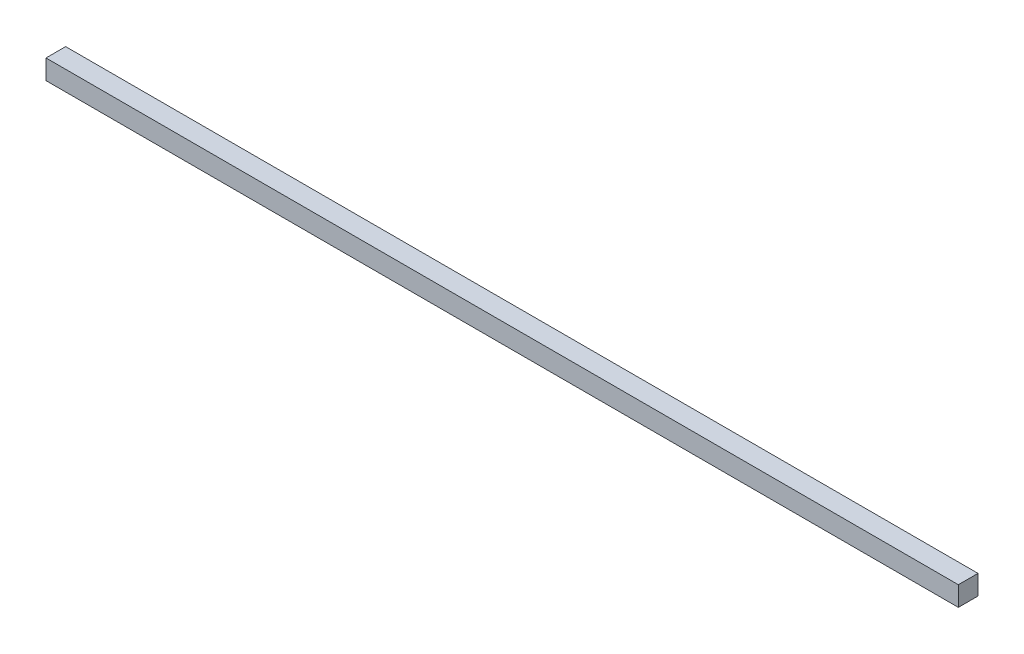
from build123d import *

# Parameters (mm, degrees)
SKETCH_1_W      = 14
SKETCH_1_H      = 14
EXTRUDE_1_DEPTH = 650


with BuildPart() as part:
    # Sketch 1 → Extrude 1 (new body)
    with BuildSketch(Plane(origin=(0, 0, 0), x_dir=(0, 0, -1), z_dir=(1, 0, 0))):
        with Locations((-32.875, 5.25)):
            Rectangle(SKETCH_1_W, SKETCH_1_H)
    extrude(amount=EXTRUDE_1_DEPTH)


solid = part.part
